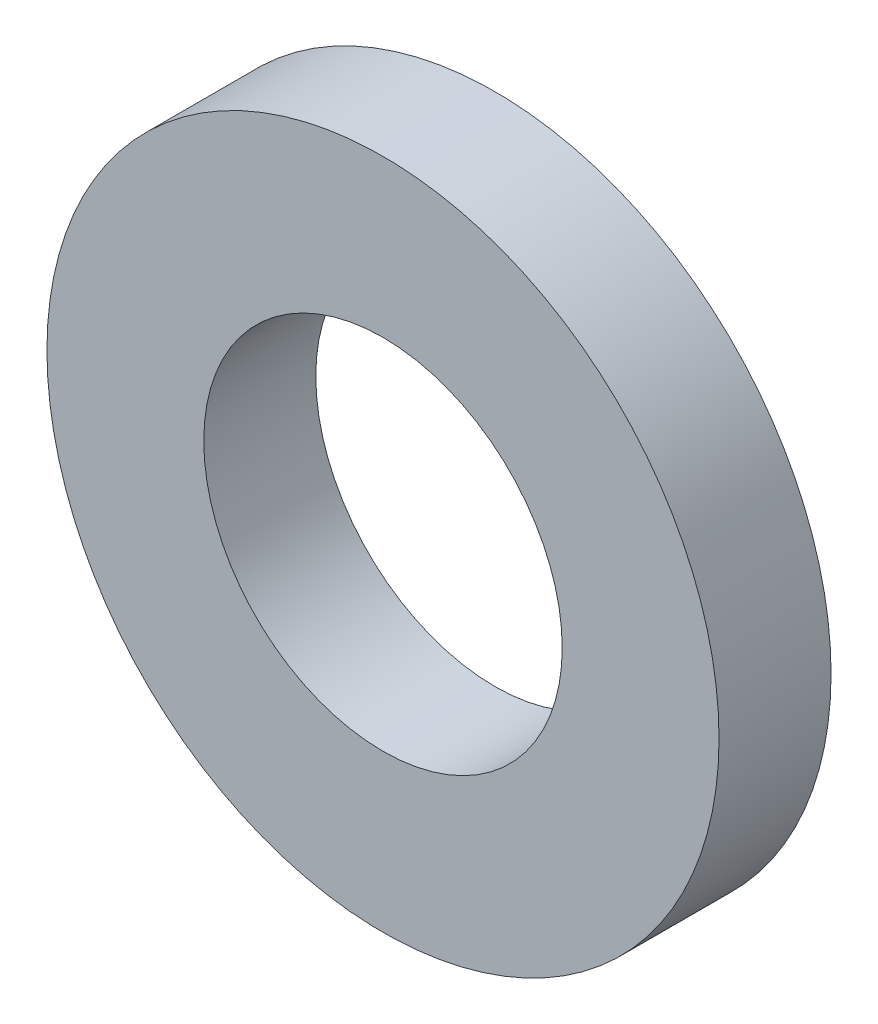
ISO-10303-21;
HEADER;
FILE_DESCRIPTION(('STEP AP214'),'2;1');
FILE_NAME('part.step','',(''),(''),'','','');
FILE_SCHEMA(('AUTOMOTIVE_DESIGN { 1 0 10303 214 1 1 1 1 }'));
ENDSEC;
DATA;
#1=APPLICATION_CONTEXT('core data for automotive mechanical design processes');
#2=APPLICATION_PROTOCOL_DEFINITION('international standard','automotive_design',2000,#1);
#3=PRODUCT_CONTEXT('',#1,'mechanical');
#4=PRODUCT('Part','Part','',(#3));
#5=PRODUCT_RELATED_PRODUCT_CATEGORY('part','',(#4));
#6=PRODUCT_DEFINITION_FORMATION('','',#4);
#7=PRODUCT_DEFINITION_CONTEXT('part definition',#1,'design');
#8=PRODUCT_DEFINITION('design','',#6,#7);
#9=PRODUCT_DEFINITION_SHAPE('','',#8);
#10=(LENGTH_UNIT() NAMED_UNIT(*) SI_UNIT(.MILLI.,.METRE.));
#11=(NAMED_UNIT(*) PLANE_ANGLE_UNIT() SI_UNIT($,.RADIAN.));
#12=(NAMED_UNIT(*) SI_UNIT($,.STERADIAN.) SOLID_ANGLE_UNIT());
#13=UNCERTAINTY_MEASURE_WITH_UNIT(LENGTH_MEASURE(1.E-05),#10,'distance_accuracy_value','');
#14=(GEOMETRIC_REPRESENTATION_CONTEXT(3) GLOBAL_UNCERTAINTY_ASSIGNED_CONTEXT((#13)) GLOBAL_UNIT_ASSIGNED_CONTEXT((#10,
#11,#12)) REPRESENTATION_CONTEXT('',''));
#15=CARTESIAN_POINT('',(0.,0.,0.));
#16=DIRECTION('',(0.,0.,1.));
#17=DIRECTION('',(1.,0.,0.));
#18=AXIS2_PLACEMENT_3D('',#15,#16,#17);
#19=CARTESIAN_POINT('',(0.,0.,1.25));
#20=DIRECTION('',(0.,0.,1.));
#21=DIRECTION('',(1.,0.,0.));
#22=AXIS2_PLACEMENT_3D('',#19,#20,#21);
#23=PLANE('',#22);
#24=CARTESIAN_POINT('',(0.,0.,1.25));
#25=DIRECTION('',(0.,0.,1.));
#26=DIRECTION('',(1.,0.,0.));
#27=AXIS2_PLACEMENT_3D('',#24,#25,#26);
#28=CIRCLE('',#27,7.5);
#29=CARTESIAN_POINT('',(7.5,0.,1.25));
#30=VERTEX_POINT('',#29);
#31=EDGE_CURVE('E10',#30,#30,#28,.T.);
#32=ORIENTED_EDGE('',*,*,#31,.T.);
#33=EDGE_LOOP('',(#32));
#34=FACE_BOUND('',#33,.T.);
#35=CARTESIAN_POINT('',(0.,0.,1.25));
#36=DIRECTION('',(0.,0.,1.));
#37=DIRECTION('',(1.,0.,0.));
#38=AXIS2_PLACEMENT_3D('',#35,#36,#37);
#39=CIRCLE('',#38,4.);
#40=CARTESIAN_POINT('',(4.,0.,1.25));
#41=VERTEX_POINT('',#40);
#42=EDGE_CURVE('E45',#41,#41,#39,.T.);
#43=ORIENTED_EDGE('',*,*,#42,.F.);
#44=EDGE_LOOP('',(#43));
#45=FACE_BOUND('',#44,.T.);
#46=ADVANCED_FACE('F34',(#34,#45),#23,.T.);
#47=CARTESIAN_POINT('',(0.,0.,-1.25));
#48=DIRECTION('',(0.,0.,1.));
#49=DIRECTION('',(1.,0.,0.));
#50=AXIS2_PLACEMENT_3D('',#47,#48,#49);
#51=PLANE('',#50);
#52=CARTESIAN_POINT('',(0.,0.,-1.25));
#53=DIRECTION('',(0.,0.,1.));
#54=DIRECTION('',(1.,0.,0.));
#55=AXIS2_PLACEMENT_3D('',#52,#53,#54);
#56=CIRCLE('',#55,7.5);
#57=CARTESIAN_POINT('',(7.5,0.,-1.25));
#58=VERTEX_POINT('',#57);
#59=EDGE_CURVE('E38',#58,#58,#56,.T.);
#60=ORIENTED_EDGE('',*,*,#59,.F.);
#61=EDGE_LOOP('',(#60));
#62=FACE_BOUND('',#61,.T.);
#63=CARTESIAN_POINT('',(0.,0.,-1.25));
#64=DIRECTION('',(0.,0.,1.));
#65=DIRECTION('',(1.,0.,0.));
#66=AXIS2_PLACEMENT_3D('',#63,#64,#65);
#67=CIRCLE('',#66,4.);
#68=CARTESIAN_POINT('',(4.,0.,-1.25));
#69=VERTEX_POINT('',#68);
#70=EDGE_CURVE('E47',#69,#69,#67,.T.);
#71=ORIENTED_EDGE('',*,*,#70,.T.);
#72=EDGE_LOOP('',(#71));
#73=FACE_BOUND('',#72,.T.);
#74=ADVANCED_FACE('F57',(#62,#73),#51,.F.);
#75=CARTESIAN_POINT('',(0.,0.,1.25));
#76=DIRECTION('',(0.,0.,-1.));
#77=DIRECTION('',(-1.,0.,0.));
#78=AXIS2_PLACEMENT_3D('',#75,#76,#77);
#79=CYLINDRICAL_SURFACE('',#78,7.5);
#80=ORIENTED_EDGE('',*,*,#31,.F.);
#81=EDGE_LOOP('',(#80));
#82=FACE_BOUND('',#81,.T.);
#83=ORIENTED_EDGE('',*,*,#59,.T.);
#84=EDGE_LOOP('',(#83));
#85=FACE_BOUND('',#84,.T.);
#86=ADVANCED_FACE('F36',(#82,#85),#79,.T.);
#87=CARTESIAN_POINT('',(0.,0.,1.25));
#88=DIRECTION('',(0.,0.,-1.));
#89=DIRECTION('',(-1.,0.,0.));
#90=AXIS2_PLACEMENT_3D('',#87,#88,#89);
#91=CYLINDRICAL_SURFACE('',#90,4.);
#92=ORIENTED_EDGE('',*,*,#42,.T.);
#93=EDGE_LOOP('',(#92));
#94=FACE_BOUND('',#93,.T.);
#95=ORIENTED_EDGE('',*,*,#70,.F.);
#96=EDGE_LOOP('',(#95));
#97=FACE_BOUND('',#96,.T.);
#98=ADVANCED_FACE('F53',(#94,#97),#91,.F.);
#99=CLOSED_SHELL('',(#46,#74,#86,#98));
#100=MANIFOLD_SOLID_BREP('B2',#99);
#101=ADVANCED_BREP_SHAPE_REPRESENTATION('',(#18,#100),#14);
#102=SHAPE_DEFINITION_REPRESENTATION(#9,#101);
ENDSEC;
END-ISO-10303-21;
